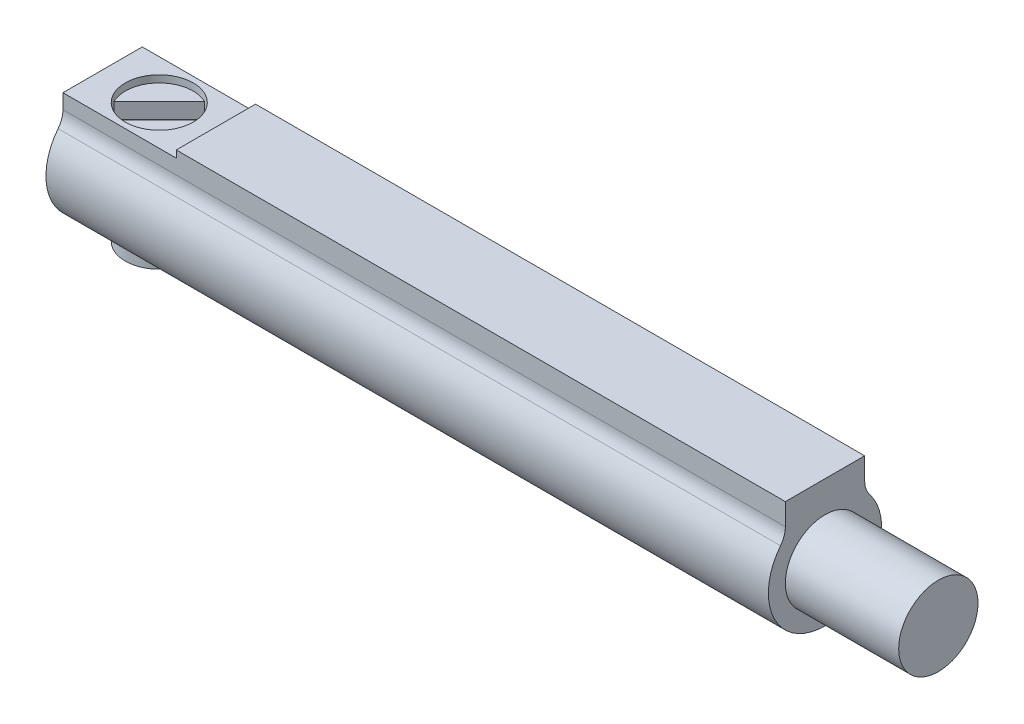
ISO-10303-21;
HEADER;
FILE_DESCRIPTION(('STEP AP214'),'2;1');
FILE_NAME('part.step','',(''),(''),'','','');
FILE_SCHEMA(('AUTOMOTIVE_DESIGN { 1 0 10303 214 1 1 1 1 }'));
ENDSEC;
DATA;
#1=APPLICATION_CONTEXT('core data for automotive mechanical design processes');
#2=APPLICATION_PROTOCOL_DEFINITION('international standard','automotive_design',2000,#1);
#3=PRODUCT_CONTEXT('',#1,'mechanical');
#4=PRODUCT('Part','Part','',(#3));
#5=PRODUCT_RELATED_PRODUCT_CATEGORY('part','',(#4));
#6=PRODUCT_DEFINITION_FORMATION('','',#4);
#7=PRODUCT_DEFINITION_CONTEXT('part definition',#1,'design');
#8=PRODUCT_DEFINITION('design','',#6,#7);
#9=PRODUCT_DEFINITION_SHAPE('','',#8);
#10=(LENGTH_UNIT() NAMED_UNIT(*) SI_UNIT(.MILLI.,.METRE.));
#11=(NAMED_UNIT(*) PLANE_ANGLE_UNIT() SI_UNIT($,.RADIAN.));
#12=(NAMED_UNIT(*) SI_UNIT($,.STERADIAN.) SOLID_ANGLE_UNIT());
#13=UNCERTAINTY_MEASURE_WITH_UNIT(LENGTH_MEASURE(1.E-05),#10,'distance_accuracy_value','');
#14=(GEOMETRIC_REPRESENTATION_CONTEXT(3) GLOBAL_UNCERTAINTY_ASSIGNED_CONTEXT((#13)) GLOBAL_UNIT_ASSIGNED_CONTEXT((#10,
#11,#12)) REPRESENTATION_CONTEXT('',''));
#15=CARTESIAN_POINT('',(0.,0.,0.));
#16=DIRECTION('',(0.,0.,1.));
#17=DIRECTION('',(1.,0.,0.));
#18=AXIS2_PLACEMENT_3D('',#15,#16,#17);
#19=CARTESIAN_POINT('',(2.,2.,0.));
#20=DIRECTION('',(0.,-1.,0.));
#21=DIRECTION('',(0.,0.,-1.));
#22=AXIS2_PLACEMENT_3D('',#19,#20,#21);
#23=PLANE('',#22);
#24=CARTESIAN_POINT('',(2.,2.,0.));
#25=DIRECTION('',(0.,-1.,0.));
#26=DIRECTION('',(0.,0.,-1.));
#27=AXIS2_PLACEMENT_3D('',#24,#25,#26);
#28=CIRCLE('',#27,1.1999999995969);
#29=CARTESIAN_POINT('',(2.517157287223,2.,-1.0828427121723));
#30=VERTEX_POINT('',#29);
#31=CARTESIAN_POINT('',(0.91715728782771,2.,0.51715728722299));
#32=VERTEX_POINT('',#31);
#33=EDGE_CURVE('E235',#30,#32,#28,.F.);
#34=ORIENTED_EDGE('',*,*,#33,.T.);
#35=DIRECTION('',(0.707106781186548,0.,-0.707106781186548));
#36=VECTOR('',#35,1.);
#37=CARTESIAN_POINT('',(1.71715728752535,2.,-0.28284271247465));
#38=LINE('',#37,#36);
#39=EDGE_CURVE('E11',#32,#30,#38,.T.);
#40=ORIENTED_EDGE('',*,*,#39,.T.);
#41=EDGE_LOOP('',(#34,#40));
#42=FACE_BOUND('',#41,.T.);
#43=ADVANCED_FACE('F33',(#42),#23,.F.);
#44=CARTESIAN_POINT('',(2.,-2.25,0.));
#45=DIRECTION('',(0.,1.,0.));
#46=DIRECTION('',(0.,0.,1.));
#47=AXIS2_PLACEMENT_3D('',#44,#45,#46);
#48=CYLINDRICAL_SURFACE('',#47,1.1999999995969);
#49=DIRECTION('',(0.,1.,0.));
#50=VECTOR('',#49,1.);
#51=CARTESIAN_POINT('',(0.91715728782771,1.45,0.51715728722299));
#52=LINE('',#51,#50);
#53=CARTESIAN_POINT('',(0.91715728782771,1.45,0.51715728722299));
#54=VERTEX_POINT('',#53);
#55=EDGE_CURVE('E155',#54,#32,#52,.T.);
#56=ORIENTED_EDGE('',*,*,#55,.T.);
#57=ORIENTED_EDGE('',*,*,#33,.F.);
#58=DIRECTION('',(0.,1.,0.));
#59=VECTOR('',#58,1.);
#60=CARTESIAN_POINT('',(2.517157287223,1.45,-1.0828427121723));
#61=LINE('',#60,#59);
#62=CARTESIAN_POINT('',(2.517157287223,1.45,-1.0828427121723));
#63=VERTEX_POINT('',#62);
#64=EDGE_CURVE('E158',#63,#30,#61,.T.);
#65=ORIENTED_EDGE('',*,*,#64,.F.);
#66=CARTESIAN_POINT('',(2.0000000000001,1.45,0.));
#67=DIRECTION('',(0.,1.,0.));
#68=DIRECTION('',(0.,0.,1.));
#69=AXIS2_PLACEMENT_3D('',#66,#67,#68);
#70=CIRCLE('',#69,1.19999999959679);
#71=CARTESIAN_POINT('',(3.08284271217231,1.45,-0.517157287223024));
#72=VERTEX_POINT('',#71);
#73=EDGE_CURVE('E147',#72,#63,#70,.T.);
#74=ORIENTED_EDGE('',*,*,#73,.F.);
#75=DIRECTION('',(0.,1.,0.));
#76=VECTOR('',#75,1.);
#77=CARTESIAN_POINT('',(3.08284271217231,1.45,-0.517157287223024));
#78=LINE('',#77,#76);
#79=CARTESIAN_POINT('',(3.08284271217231,2.,-0.517157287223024));
#80=VERTEX_POINT('',#79);
#81=EDGE_CURVE('E138',#72,#80,#78,.T.);
#82=ORIENTED_EDGE('',*,*,#81,.T.);
#83=CARTESIAN_POINT('',(1.48284271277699,2.,1.08284271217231));
#84=VERTEX_POINT('',#83);
#85=EDGE_CURVE('E137',#84,#80,#28,.F.);
#86=ORIENTED_EDGE('',*,*,#85,.F.);
#87=DIRECTION('',(0.,1.,0.));
#88=VECTOR('',#87,1.);
#89=CARTESIAN_POINT('',(1.482842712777,1.45,1.0828427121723));
#90=LINE('',#89,#88);
#91=CARTESIAN_POINT('',(1.482842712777,1.45,1.0828427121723));
#92=VERTEX_POINT('',#91);
#93=EDGE_CURVE('E48',#92,#84,#90,.T.);
#94=ORIENTED_EDGE('',*,*,#93,.F.);
#95=CARTESIAN_POINT('',(2.0000000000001,1.45,0.));
#96=DIRECTION('',(0.,1.,0.));
#97=DIRECTION('',(0.,0.,1.));
#98=AXIS2_PLACEMENT_3D('',#95,#96,#97);
#99=CIRCLE('',#98,1.19999999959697);
#100=EDGE_CURVE('E133',#54,#92,#99,.T.);
#101=ORIENTED_EDGE('',*,*,#100,.F.);
#102=EDGE_LOOP('',(#56,#57,#65,#74,#82,#86,#94,#101));
#103=FACE_BOUND('',#102,.T.);
#104=CARTESIAN_POINT('',(2.,2.25,0.));
#105=DIRECTION('',(0.,1.,0.));
#106=DIRECTION('',(0.,0.,1.));
#107=AXIS2_PLACEMENT_3D('',#104,#105,#106);
#108=CIRCLE('',#107,1.1999999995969);
#109=CARTESIAN_POINT('',(2.,2.25,1.1999999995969));
#110=VERTEX_POINT('',#109);
#111=EDGE_CURVE('E162',#110,#110,#108,.T.);
#112=ORIENTED_EDGE('',*,*,#111,.T.);
#113=EDGE_LOOP('',(#112));
#114=FACE_BOUND('',#113,.T.);
#115=ADVANCED_FACE('F130',(#103,#114),#48,.F.);
#116=CARTESIAN_POINT('',(25.5,2.25,-1.399999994));
#117=DIRECTION('',(0.,-1.,0.));
#118=DIRECTION('',(0.,0.,-1.));
#119=AXIS2_PLACEMENT_3D('',#116,#117,#118);
#120=PLANE('',#119);
#121=ORIENTED_EDGE('',*,*,#111,.F.);
#122=EDGE_LOOP('',(#121));
#123=FACE_BOUND('',#122,.T.);
#124=DIRECTION('',(0.,0.,1.));
#125=VECTOR('',#124,1.);
#126=CARTESIAN_POINT('',(4.,2.25,-1.399999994));
#127=LINE('',#126,#125);
#128=CARTESIAN_POINT('',(4.,2.25,-1.399999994));
#129=VERTEX_POINT('',#128);
#130=CARTESIAN_POINT('',(4.,2.25,1.399999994));
#131=VERTEX_POINT('',#130);
#132=EDGE_CURVE('E184',#129,#131,#127,.T.);
#133=ORIENTED_EDGE('',*,*,#132,.F.);
#134=DIRECTION('',(-1.,0.,0.));
#135=VECTOR('',#134,1.);
#136=CARTESIAN_POINT('',(25.5,2.25,-1.399999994));
#137=LINE('',#136,#135);
#138=CARTESIAN_POINT('',(0.,2.25,-1.399999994));
#139=VERTEX_POINT('',#138);
#140=EDGE_CURVE('E222',#129,#139,#137,.T.);
#141=ORIENTED_EDGE('',*,*,#140,.T.);
#142=DIRECTION('',(0.,0.,1.));
#143=VECTOR('',#142,1.);
#144=CARTESIAN_POINT('',(0.,2.25,-1.399999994));
#145=LINE('',#144,#143);
#146=CARTESIAN_POINT('',(0.,2.25,1.399999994));
#147=VERTEX_POINT('',#146);
#148=EDGE_CURVE('E214',#139,#147,#145,.T.);
#149=ORIENTED_EDGE('',*,*,#148,.T.);
#150=DIRECTION('',(-1.,0.,0.));
#151=VECTOR('',#150,1.);
#152=CARTESIAN_POINT('',(25.5,2.25,1.399999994));
#153=LINE('',#152,#151);
#154=EDGE_CURVE('E220',#131,#147,#153,.T.);
#155=ORIENTED_EDGE('',*,*,#154,.F.);
#156=EDGE_LOOP('',(#133,#141,#149,#155));
#157=FACE_BOUND('',#156,.T.);
#158=ADVANCED_FACE('F248',(#123,#157),#120,.F.);
#159=CARTESIAN_POINT('',(25.5,1.73205095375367,2.20000039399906));
#160=DIRECTION('',(-1.,0.,0.));
#161=DIRECTION('',(0.,0.,1.));
#162=AXIS2_PLACEMENT_3D('',#159,#160,#161);
#163=PLANE('',#162);
#164=CARTESIAN_POINT('',(25.5,0.,0.));
#165=DIRECTION('',(-1.,0.,0.));
#166=DIRECTION('',(0.,0.,1.));
#167=AXIS2_PLACEMENT_3D('',#164,#165,#166);
#168=CIRCLE('',#167,1.399999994);
#169=CARTESIAN_POINT('',(25.5,0.,1.399999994));
#170=VERTEX_POINT('',#169);
#171=EDGE_CURVE('E232',#170,#170,#168,.F.);
#172=ORIENTED_EDGE('',*,*,#171,.F.);
#173=EDGE_LOOP('',(#172));
#174=FACE_BOUND('',#173,.T.);
#175=DIRECTION('',(0.,-1.,0.));
#176=VECTOR('',#175,1.);
#177=CARTESIAN_POINT('',(25.5,2.25,1.399999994));
#178=LINE('',#177,#176);
#179=CARTESIAN_POINT('',(25.5,2.5,1.399999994));
#180=VERTEX_POINT('',#179);
#181=CARTESIAN_POINT('',(25.5,1.732050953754,1.399999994));
#182=VERTEX_POINT('',#181);
#183=EDGE_CURVE('E201',#180,#182,#178,.T.);
#184=ORIENTED_EDGE('',*,*,#183,.T.);
#185=CARTESIAN_POINT('',(25.5,1.73205095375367,2.20000039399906));
#186=DIRECTION('',(-1.,0.,0.));
#187=DIRECTION('',(0.,0.,1.));
#188=AXIS2_PLACEMENT_3D('',#185,#186,#187);
#189=CIRCLE('',#188,0.800000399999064);
#190=CARTESIAN_POINT('',(25.5,1.2371790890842,1.5714286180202));
#191=VERTEX_POINT('',#190);
#192=EDGE_CURVE('E191',#182,#191,#189,.T.);
#193=ORIENTED_EDGE('',*,*,#192,.T.);
#194=CARTESIAN_POINT('',(25.5,0.,0.));
#195=DIRECTION('',(1.,0.,0.));
#196=DIRECTION('',(0.,0.,-1.));
#197=AXIS2_PLACEMENT_3D('',#194,#195,#196);
#198=CIRCLE('',#197,2.00000000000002);
#199=CARTESIAN_POINT('',(25.5,1.2371791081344,-1.5714286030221));
#200=VERTEX_POINT('',#199);
#201=EDGE_CURVE('E194',#191,#200,#198,.T.);
#202=ORIENTED_EDGE('',*,*,#201,.T.);
#203=CARTESIAN_POINT('',(25.5,1.73205095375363,-2.20000039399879));
#204=DIRECTION('',(-1.,0.,0.));
#205=DIRECTION('',(0.,0.,1.));
#206=AXIS2_PLACEMENT_3D('',#203,#204,#205);
#207=CIRCLE('',#206,0.800000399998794);
#208=CARTESIAN_POINT('',(25.5,1.732050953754,-1.399999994));
#209=VERTEX_POINT('',#208);
#210=EDGE_CURVE('E197',#200,#209,#207,.T.);
#211=ORIENTED_EDGE('',*,*,#210,.T.);
#212=DIRECTION('',(0.,1.,0.));
#213=VECTOR('',#212,1.);
#214=CARTESIAN_POINT('',(25.5,1.732050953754,-1.399999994));
#215=LINE('',#214,#213);
#216=CARTESIAN_POINT('',(25.5,2.5,-1.399999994));
#217=VERTEX_POINT('',#216);
#218=EDGE_CURVE('E199',#209,#217,#215,.T.);
#219=ORIENTED_EDGE('',*,*,#218,.T.);
#220=DIRECTION('',(0.,0.,1.));
#221=VECTOR('',#220,1.);
#222=CARTESIAN_POINT('',(25.5,2.5,-1.399999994));
#223=LINE('',#222,#221);
#224=EDGE_CURVE('E166',#217,#180,#223,.T.);
#225=ORIENTED_EDGE('',*,*,#224,.T.);
#226=EDGE_LOOP('',(#184,#193,#202,#211,#219,#225));
#227=FACE_BOUND('',#226,.T.);
#228=ADVANCED_FACE('F268',(#174,#227),#163,.F.);
#229=CARTESIAN_POINT('',(25.5,1.73205095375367,2.20000039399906));
#230=DIRECTION('',(-1.,0.,0.));
#231=DIRECTION('',(0.,0.,1.));
#232=AXIS2_PLACEMENT_3D('',#229,#230,#231);
#233=CYLINDRICAL_SURFACE('',#232,0.800000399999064);
#234=CARTESIAN_POINT('',(0.,1.73205095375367,2.20000039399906));
#235=DIRECTION('',(-1.,0.,0.));
#236=DIRECTION('',(0.,0.,1.));
#237=AXIS2_PLACEMENT_3D('',#234,#235,#236);
#238=CIRCLE('',#237,0.800000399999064);
#239=CARTESIAN_POINT('',(0.,1.732050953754,1.399999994));
#240=VERTEX_POINT('',#239);
#241=CARTESIAN_POINT('',(0.,1.2371790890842,1.5714286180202));
#242=VERTEX_POINT('',#241);
#243=EDGE_CURVE('E190',#240,#242,#238,.T.);
#244=ORIENTED_EDGE('',*,*,#243,.T.);
#245=DIRECTION('',(-1.,0.,0.));
#246=VECTOR('',#245,1.);
#247=CARTESIAN_POINT('',(25.5,1.2371790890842,1.5714286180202));
#248=LINE('',#247,#246);
#249=EDGE_CURVE('E229',#191,#242,#248,.T.);
#250=ORIENTED_EDGE('',*,*,#249,.F.);
#251=ORIENTED_EDGE('',*,*,#192,.F.);
#252=DIRECTION('',(-1.,0.,0.));
#253=VECTOR('',#252,1.);
#254=CARTESIAN_POINT('',(25.5,1.732050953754,1.399999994));
#255=LINE('',#254,#253);
#256=EDGE_CURVE('E203',#182,#240,#255,.T.);
#257=ORIENTED_EDGE('',*,*,#256,.T.);
#258=EDGE_LOOP('',(#244,#250,#251,#257));
#259=FACE_BOUND('',#258,.T.);
#260=ADVANCED_FACE('F35',(#259),#233,.F.);
#261=CARTESIAN_POINT('',(25.5,0.,0.));
#262=DIRECTION('',(-1.,0.,0.));
#263=DIRECTION('',(0.,0.,1.));
#264=AXIS2_PLACEMENT_3D('',#261,#262,#263);
#265=CYLINDRICAL_SURFACE('',#264,2.00000000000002);
#266=CARTESIAN_POINT('',(2.,-1.60000000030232,1.1999999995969));
#267=CARTESIAN_POINT('',(2.06038318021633,-1.59999533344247,1.20000323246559));
#268=CARTESIAN_POINT('',(2.12075074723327,-1.60346907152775,1.19541482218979));
#269=CARTESIAN_POINT('',(2.23945912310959,-1.61674072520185,1.17739972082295));
#270=CARTESIAN_POINT('',(2.29779774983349,-1.62654524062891,1.16396380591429));
#271=CARTESIAN_POINT('',(2.41046691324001,-1.65089871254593,1.12914789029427));
#272=CARTESIAN_POINT('',(2.46482307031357,-1.66541332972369,1.107825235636));
#273=CARTESIAN_POINT('',(2.56914996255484,-1.69748724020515,1.05802327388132));
#274=CARTESIAN_POINT('',(2.61911938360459,-1.71504744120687,1.02954183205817));
#275=CARTESIAN_POINT('',(2.71995921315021,-1.75382875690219,0.962170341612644));
#276=CARTESIAN_POINT('',(2.77019276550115,-1.77523496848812,0.922433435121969));
#277=CARTESIAN_POINT('',(2.86381180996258,-1.81780983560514,0.835414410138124));
#278=CARTESIAN_POINT('',(2.90719212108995,-1.83897830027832,0.788126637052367));
#279=CARTESIAN_POINT('',(2.9905070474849,-1.88140454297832,0.681153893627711));
#280=CARTESIAN_POINT('',(3.02956357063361,-1.90242506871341,0.620681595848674));
#281=CARTESIAN_POINT('',(3.09664777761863,-1.93955029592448,0.492523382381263));
#282=CARTESIAN_POINT('',(3.12468557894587,-1.95565950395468,0.424844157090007));
#283=CARTESIAN_POINT('',(3.16607673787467,-1.97976790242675,0.291017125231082));
#284=CARTESIAN_POINT('',(3.18057628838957,-1.98839443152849,0.225339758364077));
#285=CARTESIAN_POINT('',(3.19835424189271,-1.9989995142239,0.0919764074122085));
#286=CARTESIAN_POINT('',(3.20164318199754,-2.00098431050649,0.0242923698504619));
#287=CARTESIAN_POINT('',(3.19710900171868,-1.99826698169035,-0.102109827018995));
#288=CARTESIAN_POINT('',(3.19061317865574,-1.99436350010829,-0.160899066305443));
#289=CARTESIAN_POINT('',(3.16921616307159,-1.98166398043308,-0.276371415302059));
#290=CARTESIAN_POINT('',(3.15431434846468,-1.97286758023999,-0.333054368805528));
#291=CARTESIAN_POINT('',(3.11666754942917,-1.95107925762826,-0.443245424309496));
#292=CARTESIAN_POINT('',(3.09387755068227,-1.93806328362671,-0.496733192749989));
#293=CARTESIAN_POINT('',(3.04129230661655,-1.90887710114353,-0.599190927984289));
#294=CARTESIAN_POINT('',(3.01149524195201,-1.89270607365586,-0.648159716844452));
#295=CARTESIAN_POINT('',(2.9417287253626,-1.85630340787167,-0.746459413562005));
#296=CARTESIAN_POINT('',(2.90096935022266,-1.8358174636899,-0.795134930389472));
#297=CARTESIAN_POINT('',(2.81247670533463,-1.7940444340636,-0.885371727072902));
#298=CARTESIAN_POINT('',(2.76473399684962,-1.77275629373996,-0.926923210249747));
#299=CARTESIAN_POINT('',(2.65707727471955,-1.72888860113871,-1.00659870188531));
#300=CARTESIAN_POINT('',(2.59639393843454,-1.70644529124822,-1.04376746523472));
#301=CARTESIAN_POINT('',(2.46823501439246,-1.66600703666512,-1.10717773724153));
#302=CARTESIAN_POINT('',(2.40077222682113,-1.64800392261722,-1.13343937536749));
#303=CARTESIAN_POINT('',(2.27808509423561,-1.62316692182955,-1.16861997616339));
#304=CARTESIAN_POINT('',(2.22396749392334,-1.61467110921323,-1.18022322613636));
#305=CARTESIAN_POINT('',(2.11410111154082,-1.60313720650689,-1.19584698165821));
#306=CARTESIAN_POINT('',(2.05835430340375,-1.60009276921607,-1.1998763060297));
#307=CARTESIAN_POINT('',(1.94675865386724,-1.59991131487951,-1.20011824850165));
#308=CARTESIAN_POINT('',(1.89090977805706,-1.60278248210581,-1.19632003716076));
#309=CARTESIAN_POINT('',(1.78081012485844,-1.61401216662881,-1.1811223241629));
#310=CARTESIAN_POINT('',(1.72656064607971,-1.62237502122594,-1.16971681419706));
#311=CARTESIAN_POINT('',(1.62102833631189,-1.64345414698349,-1.13990650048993));
#312=CARTESIAN_POINT('',(1.56974189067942,-1.65616497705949,-1.12151044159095));
#313=CARTESIAN_POINT('',(1.47081782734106,-1.68457231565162,-1.07837008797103));
#314=CARTESIAN_POINT('',(1.42318159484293,-1.70026994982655,-1.05362339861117));
#315=CARTESIAN_POINT('',(1.32380793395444,-1.73629455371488,-0.993339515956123));
#316=CARTESIAN_POINT('',(1.27287933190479,-1.75694591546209,-0.956661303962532));
#317=CARTESIAN_POINT('',(1.17737161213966,-1.79857403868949,-0.87589916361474));
#318=CARTESIAN_POINT('',(1.13279864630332,-1.8195510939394,-0.831808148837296));
#319=CARTESIAN_POINT('',(1.04542079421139,-1.86268500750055,-0.730619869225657));
#320=CARTESIAN_POINT('',(1.00359941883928,-1.88464060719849,-0.672576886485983));
#321=CARTESIAN_POINT('',(0.930477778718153,-1.92430111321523,-0.548882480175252));
#322=CARTESIAN_POINT('',(0.89917053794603,-1.9420088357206,-0.483236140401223));
#323=CARTESIAN_POINT('',(0.850505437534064,-1.97001824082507,-0.351072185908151));
#324=CARTESIAN_POINT('',(0.832299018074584,-1.98076470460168,-0.284964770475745));
#325=CARTESIAN_POINT('',(0.807428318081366,-1.99552591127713,-0.149906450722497));
#326=CARTESIAN_POINT('',(0.800750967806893,-1.99954827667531,-0.0809588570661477));
#327=CARTESIAN_POINT('',(0.799460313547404,-2.00032480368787,0.0478496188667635));
#328=CARTESIAN_POINT('',(0.803357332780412,-1.99797645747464,0.107696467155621));
#329=CARTESIAN_POINT('',(0.81991505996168,-1.98810358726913,0.22571900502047));
#330=CARTESIAN_POINT('',(0.832575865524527,-1.98057900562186,0.283894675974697));
#331=CARTESIAN_POINT('',(0.865775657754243,-1.96119542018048,0.396116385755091));
#332=CARTESIAN_POINT('',(0.886185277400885,-1.94940773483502,0.450213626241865));
#333=CARTESIAN_POINT('',(0.93411247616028,-1.92242669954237,0.554225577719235));
#334=CARTESIAN_POINT('',(0.961631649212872,-1.90723258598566,0.604139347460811));
#335=CARTESIAN_POINT('',(1.02634015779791,-1.87274746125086,0.704210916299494));
#336=CARTESIAN_POINT('',(1.0642549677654,-1.85319075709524,0.75380695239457));
#337=CARTESIAN_POINT('',(1.14700242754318,-1.81281525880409,0.846318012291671));
#338=CARTESIAN_POINT('',(1.19184274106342,-1.79199508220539,0.889225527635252));
#339=CARTESIAN_POINT('',(1.29382845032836,-1.74822532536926,0.972727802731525));
#340=CARTESIAN_POINT('',(1.35181318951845,-1.72534053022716,1.0123392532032));
#341=CARTESIAN_POINT('',(1.47478788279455,-1.68301171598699,1.08125453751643));
#342=CARTESIAN_POINT('',(1.53977417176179,-1.66356591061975,1.11056373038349));
#343=CARTESIAN_POINT('',(1.66965142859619,-1.63264002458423,1.1554969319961));
#344=CARTESIAN_POINT('',(1.73407618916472,-1.62062132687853,1.1720762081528));
#345=CARTESIAN_POINT('',(1.86567791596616,-1.60431225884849,1.19431414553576));
#346=CARTESIAN_POINT('',(1.93284861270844,-1.60000519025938,1.19999640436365));
#347=CARTESIAN_POINT('',(2.,-1.60000000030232,1.1999999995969));
#348=B_SPLINE_CURVE_WITH_KNOTS('',3,(#266,#267,#268,#269,#270,#271,#272,#273,#274,#275,#276,
#277,#278,#279,#280,#281,#282,#283,#284,#285,#286,#287,#288,#289,#290,#291,#292,#293,#294,#295,
#296,#297,#298,#299,#300,#301,#302,#303,#304,#305,#306,#307,#308,#309,#310,#311,#312,#313,#314,
#315,#316,#317,#318,#319,#320,#321,#322,#323,#324,#325,#326,#327,#328,#329,#330,#331,#332,#333,
#334,#335,#336,#337,#338,#339,#340,#341,#342,#343,#344,#345,#346,#347),.UNSPECIFIED.,.T.,.F.,(4,
2,2,2,2,2,2,2,2,2,2,2,2,2,2,2,2,2,2,2,2,2,2,2,2,2,2,2,2,2,2,2,2,2,2,2,2,2,2,2,4),(0.,
0.180868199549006,0.361925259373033,0.54169089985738,0.721510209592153,0.923315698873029,
1.12527302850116,1.34904126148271,1.57260354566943,1.77482664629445,1.97685962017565,
2.15384104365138,2.33083556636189,2.50885723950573,2.68692518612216,2.88626247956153,
3.08587173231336,3.30861336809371,3.53094208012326,3.69821038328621,3.86528380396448,
4.03258852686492,4.2000255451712,4.36725379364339,4.53454519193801,4.73199550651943,
4.92963566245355,5.15297462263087,5.37616510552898,5.58313183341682,5.78986378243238,
5.96903457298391,6.14820735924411,6.32451175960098,6.50085572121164,6.6963437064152,
6.89204958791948,7.11257356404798,7.33298265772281,7.53456095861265,7.73570224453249),.UNSPECIFIED.);
#349=CARTESIAN_POINT('',(3.1999999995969,-2.,0.));
#350=VERTEX_POINT('',#349);
#351=CARTESIAN_POINT('',(0.8000000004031,-2.,0.));
#352=VERTEX_POINT('',#351);
#353=EDGE_CURVE('E175',#350,#352,#348,.T.);
#354=ORIENTED_EDGE('',*,*,#353,.T.);
#355=EDGE_CURVE('E165',#352,#350,#348,.T.);
#356=ORIENTED_EDGE('',*,*,#355,.T.);
#357=EDGE_LOOP('',(#354,#356));
#358=FACE_BOUND('',#357,.T.);
#359=CARTESIAN_POINT('',(0.,0.,0.));
#360=DIRECTION('',(1.,0.,0.));
#361=DIRECTION('',(0.,0.,-1.));
#362=AXIS2_PLACEMENT_3D('',#359,#360,#361);
#363=CIRCLE('',#362,2.00000000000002);
#364=CARTESIAN_POINT('',(0.,1.2371791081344,-1.5714286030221));
#365=VERTEX_POINT('',#364);
#366=EDGE_CURVE('E206',#242,#365,#363,.T.);
#367=ORIENTED_EDGE('',*,*,#366,.T.);
#368=DIRECTION('',(-1.,0.,0.));
#369=VECTOR('',#368,1.);
#370=CARTESIAN_POINT('',(25.5,1.2371791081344,-1.5714286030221));
#371=LINE('',#370,#369);
#372=EDGE_CURVE('E226',#200,#365,#371,.T.);
#373=ORIENTED_EDGE('',*,*,#372,.F.);
#374=ORIENTED_EDGE('',*,*,#201,.F.);
#375=ORIENTED_EDGE('',*,*,#249,.T.);
#376=EDGE_LOOP('',(#367,#373,#374,#375));
#377=FACE_BOUND('',#376,.T.);
#378=ADVANCED_FACE('F241',(#358,#377),#265,.T.);
#379=CARTESIAN_POINT('',(25.5,1.73205095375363,-2.20000039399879));
#380=DIRECTION('',(-1.,0.,0.));
#381=DIRECTION('',(0.,0.,1.));
#382=AXIS2_PLACEMENT_3D('',#379,#380,#381);
#383=CYLINDRICAL_SURFACE('',#382,0.800000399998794);
#384=CARTESIAN_POINT('',(0.,1.73205095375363,-2.20000039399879));
#385=DIRECTION('',(-1.,0.,0.));
#386=DIRECTION('',(0.,0.,1.));
#387=AXIS2_PLACEMENT_3D('',#384,#385,#386);
#388=CIRCLE('',#387,0.800000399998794);
#389=CARTESIAN_POINT('',(0.,1.732050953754,-1.399999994));
#390=VERTEX_POINT('',#389);
#391=EDGE_CURVE('E208',#365,#390,#388,.T.);
#392=ORIENTED_EDGE('',*,*,#391,.T.);
#393=DIRECTION('',(-1.,0.,0.));
#394=VECTOR('',#393,1.);
#395=CARTESIAN_POINT('',(25.5,1.732050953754,-1.399999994));
#396=LINE('',#395,#394);
#397=EDGE_CURVE('E224',#209,#390,#396,.T.);
#398=ORIENTED_EDGE('',*,*,#397,.F.);
#399=ORIENTED_EDGE('',*,*,#210,.F.);
#400=ORIENTED_EDGE('',*,*,#372,.T.);
#401=EDGE_LOOP('',(#392,#398,#399,#400));
#402=FACE_BOUND('',#401,.T.);
#403=ADVANCED_FACE('F284',(#402),#383,.F.);
#404=CARTESIAN_POINT('',(25.5,1.732050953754,-1.399999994));
#405=DIRECTION('',(0.,0.,1.));
#406=DIRECTION('',(1.,0.,0.));
#407=AXIS2_PLACEMENT_3D('',#404,#405,#406);
#408=PLANE('',#407);
#409=ORIENTED_EDGE('',*,*,#397,.T.);
#410=DIRECTION('',(0.,1.,0.));
#411=VECTOR('',#410,1.);
#412=CARTESIAN_POINT('',(0.,1.732050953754,-1.399999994));
#413=LINE('',#412,#411);
#414=EDGE_CURVE('E211',#390,#139,#413,.T.);
#415=ORIENTED_EDGE('',*,*,#414,.T.);
#416=ORIENTED_EDGE('',*,*,#140,.F.);
#417=DIRECTION('',(0.,1.,0.));
#418=VECTOR('',#417,1.);
#419=CARTESIAN_POINT('',(4.,0.5,-1.399999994));
#420=LINE('',#419,#418);
#421=CARTESIAN_POINT('',(4.,2.5,-1.399999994));
#422=VERTEX_POINT('',#421);
#423=EDGE_CURVE('E170',#129,#422,#420,.T.);
#424=ORIENTED_EDGE('',*,*,#423,.T.);
#425=DIRECTION('',(-1.,0.,0.));
#426=VECTOR('',#425,1.);
#427=CARTESIAN_POINT('',(25.5,2.5,-1.399999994));
#428=LINE('',#427,#426);
#429=EDGE_CURVE('E169',#217,#422,#428,.T.);
#430=ORIENTED_EDGE('',*,*,#429,.F.);
#431=ORIENTED_EDGE('',*,*,#218,.F.);
#432=EDGE_LOOP('',(#409,#415,#416,#424,#430,#431));
#433=FACE_BOUND('',#432,.T.);
#434=ADVANCED_FACE('F278',(#433),#408,.F.);
#435=CARTESIAN_POINT('',(25.5,2.25,1.399999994));
#436=DIRECTION('',(0.,0.,-1.));
#437=DIRECTION('',(-1.,0.,0.));
#438=AXIS2_PLACEMENT_3D('',#435,#436,#437);
#439=PLANE('',#438);
#440=ORIENTED_EDGE('',*,*,#183,.F.);
#441=DIRECTION('',(-1.,0.,0.));
#442=VECTOR('',#441,1.);
#443=CARTESIAN_POINT('',(25.5,2.5,1.399999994));
#444=LINE('',#443,#442);
#445=CARTESIAN_POINT('',(4.,2.5,1.399999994));
#446=VERTEX_POINT('',#445);
#447=EDGE_CURVE('E181',#180,#446,#444,.T.);
#448=ORIENTED_EDGE('',*,*,#447,.T.);
#449=DIRECTION('',(0.,-1.,0.));
#450=VECTOR('',#449,1.);
#451=CARTESIAN_POINT('',(4.,2.5,1.399999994));
#452=LINE('',#451,#450);
#453=EDGE_CURVE('E174',#446,#131,#452,.T.);
#454=ORIENTED_EDGE('',*,*,#453,.T.);
#455=ORIENTED_EDGE('',*,*,#154,.T.);
#456=DIRECTION('',(0.,-1.,0.));
#457=VECTOR('',#456,1.);
#458=CARTESIAN_POINT('',(0.,2.25,1.399999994));
#459=LINE('',#458,#457);
#460=EDGE_CURVE('E195',#147,#240,#459,.T.);
#461=ORIENTED_EDGE('',*,*,#460,.T.);
#462=ORIENTED_EDGE('',*,*,#256,.F.);
#463=EDGE_LOOP('',(#440,#448,#454,#455,#461,#462));
#464=FACE_BOUND('',#463,.T.);
#465=ADVANCED_FACE('F274',(#464),#439,.F.);
#466=CARTESIAN_POINT('',(0.,1.73205095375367,2.20000039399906));
#467=DIRECTION('',(-1.,0.,0.));
#468=DIRECTION('',(0.,0.,1.));
#469=AXIS2_PLACEMENT_3D('',#466,#467,#468);
#470=PLANE('',#469);
#471=ORIENTED_EDGE('',*,*,#243,.F.);
#472=ORIENTED_EDGE('',*,*,#460,.F.);
#473=ORIENTED_EDGE('',*,*,#148,.F.);
#474=ORIENTED_EDGE('',*,*,#414,.F.);
#475=ORIENTED_EDGE('',*,*,#391,.F.);
#476=ORIENTED_EDGE('',*,*,#366,.F.);
#477=EDGE_LOOP('',(#471,#472,#473,#474,#475,#476));
#478=FACE_BOUND('',#477,.T.);
#479=ADVANCED_FACE('F266',(#478),#470,.T.);
#480=CARTESIAN_POINT('',(29.5,0.,0.));
#481=DIRECTION('',(-1.,0.,0.));
#482=DIRECTION('',(0.,0.,1.));
#483=AXIS2_PLACEMENT_3D('',#480,#481,#482);
#484=CYLINDRICAL_SURFACE('',#483,1.399999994);
#485=CARTESIAN_POINT('',(29.5,0.,0.));
#486=DIRECTION('',(1.,0.,0.));
#487=DIRECTION('',(0.,0.,-1.));
#488=AXIS2_PLACEMENT_3D('',#485,#486,#487);
#489=CIRCLE('',#488,1.399999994);
#490=CARTESIAN_POINT('',(29.5,0.,-1.399999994));
#491=VERTEX_POINT('',#490);
#492=EDGE_CURVE('E187',#491,#491,#489,.T.);
#493=ORIENTED_EDGE('',*,*,#492,.F.);
#494=EDGE_LOOP('',(#493));
#495=FACE_BOUND('',#494,.T.);
#496=ORIENTED_EDGE('',*,*,#171,.T.);
#497=EDGE_LOOP('',(#496));
#498=FACE_BOUND('',#497,.T.);
#499=ADVANCED_FACE('F262',(#495,#498),#484,.T.);
#500=CARTESIAN_POINT('',(29.5,0.,0.));
#501=DIRECTION('',(1.,0.,0.));
#502=DIRECTION('',(0.,0.,-1.));
#503=AXIS2_PLACEMENT_3D('',#500,#501,#502);
#504=PLANE('',#503);
#505=ORIENTED_EDGE('',*,*,#492,.T.);
#506=EDGE_LOOP('',(#505));
#507=FACE_BOUND('',#506,.T.);
#508=ADVANCED_FACE('F255',(#507),#504,.T.);
#509=CARTESIAN_POINT('',(4.,2.5,1.399999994));
#510=DIRECTION('',(1.,0.,0.));
#511=DIRECTION('',(0.,0.,-1.));
#512=AXIS2_PLACEMENT_3D('',#509,#510,#511);
#513=PLANE('',#512);
#514=ORIENTED_EDGE('',*,*,#423,.F.);
#515=ORIENTED_EDGE('',*,*,#132,.T.);
#516=ORIENTED_EDGE('',*,*,#453,.F.);
#517=DIRECTION('',(0.,0.,1.));
#518=VECTOR('',#517,1.);
#519=CARTESIAN_POINT('',(4.,2.5,-1.399999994));
#520=LINE('',#519,#518);
#521=EDGE_CURVE('E171',#422,#446,#520,.T.);
#522=ORIENTED_EDGE('',*,*,#521,.F.);
#523=EDGE_LOOP('',(#514,#515,#516,#522));
#524=FACE_BOUND('',#523,.T.);
#525=ADVANCED_FACE('F251',(#524),#513,.F.);
#526=CARTESIAN_POINT('',(25.5,2.5,-1.399999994));
#527=DIRECTION('',(0.,-1.,0.));
#528=DIRECTION('',(0.,0.,-1.));
#529=AXIS2_PLACEMENT_3D('',#526,#527,#528);
#530=PLANE('',#529);
#531=ORIENTED_EDGE('',*,*,#521,.T.);
#532=ORIENTED_EDGE('',*,*,#447,.F.);
#533=ORIENTED_EDGE('',*,*,#224,.F.);
#534=ORIENTED_EDGE('',*,*,#429,.T.);
#535=EDGE_LOOP('',(#531,#532,#533,#534));
#536=FACE_BOUND('',#535,.T.);
#537=ADVANCED_FACE('F254',(#536),#530,.F.);
#538=ORIENTED_EDGE('',*,*,#85,.T.);
#539=DIRECTION('',(-0.707106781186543,0.,0.707106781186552));
#540=VECTOR('',#539,1.);
#541=CARTESIAN_POINT('',(2.28284271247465,2.,0.282842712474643));
#542=LINE('',#541,#540);
#543=EDGE_CURVE('E41',#80,#84,#542,.T.);
#544=ORIENTED_EDGE('',*,*,#543,.T.);
#545=EDGE_LOOP('',(#538,#544));
#546=FACE_BOUND('',#545,.T.);
#547=ADVANCED_FACE('F249',(#546),#23,.F.);
#548=CARTESIAN_POINT('',(2.,-2.,0.));
#549=DIRECTION('',(0.,1.,0.));
#550=DIRECTION('',(0.,0.,1.));
#551=AXIS2_PLACEMENT_3D('',#548,#549,#550);
#552=CYLINDRICAL_SURFACE('',#551,1.1999999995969);
#553=CARTESIAN_POINT('',(2.,-2.,0.));
#554=DIRECTION('',(0.,1.,0.));
#555=DIRECTION('',(0.,0.,1.));
#556=AXIS2_PLACEMENT_3D('',#553,#554,#555);
#557=CIRCLE('',#556,1.1999999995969);
#558=EDGE_CURVE('E55',#350,#352,#557,.T.);
#559=ORIENTED_EDGE('',*,*,#558,.T.);
#560=ORIENTED_EDGE('',*,*,#353,.F.);
#561=EDGE_LOOP('',(#559,#560));
#562=FACE_BOUND('',#561,.T.);
#563=ADVANCED_FACE('F298',(#562),#552,.T.);
#564=EDGE_CURVE('E157',#352,#350,#557,.T.);
#565=ORIENTED_EDGE('',*,*,#564,.T.);
#566=ORIENTED_EDGE('',*,*,#355,.F.);
#567=EDGE_LOOP('',(#565,#566));
#568=FACE_BOUND('',#567,.T.);
#569=ADVANCED_FACE('F303',(#568),#552,.T.);
#570=CARTESIAN_POINT('',(3.1999999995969,-2.,0.));
#571=DIRECTION('',(0.,1.,0.));
#572=DIRECTION('',(0.,0.,1.));
#573=AXIS2_PLACEMENT_3D('',#570,#571,#572);
#574=PLANE('',#573);
#575=ORIENTED_EDGE('',*,*,#558,.F.);
#576=ORIENTED_EDGE('',*,*,#564,.F.);
#577=EDGE_LOOP('',(#575,#576));
#578=FACE_BOUND('',#577,.T.);
#579=ADVANCED_FACE('F309',(#578),#574,.F.);
#580=CARTESIAN_POINT('',(2.517157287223,1.45,-1.0828427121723));
#581=DIRECTION('',(-0.707106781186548,0.,-0.707106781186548));
#582=DIRECTION('',(-0.707106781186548,0.,0.707106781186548));
#583=AXIS2_PLACEMENT_3D('',#580,#581,#582);
#584=PLANE('',#583);
#585=ORIENTED_EDGE('',*,*,#55,.F.);
#586=DIRECTION('',(-0.707106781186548,0.,0.707106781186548));
#587=VECTOR('',#586,1.);
#588=CARTESIAN_POINT('',(2.517157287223,1.45,-1.0828427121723));
#589=LINE('',#588,#587);
#590=EDGE_CURVE('E139',#63,#54,#589,.T.);
#591=ORIENTED_EDGE('',*,*,#590,.F.);
#592=ORIENTED_EDGE('',*,*,#64,.T.);
#593=ORIENTED_EDGE('',*,*,#39,.F.);
#594=EDGE_LOOP('',(#585,#591,#592,#593));
#595=FACE_BOUND('',#594,.T.);
#596=ADVANCED_FACE('F307',(#595),#584,.F.);
#597=CARTESIAN_POINT('',(1.482842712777,1.45,1.0828427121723));
#598=DIRECTION('',(0.707106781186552,0.,0.707106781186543));
#599=DIRECTION('',(0.707106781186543,0.,-0.707106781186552));
#600=AXIS2_PLACEMENT_3D('',#597,#598,#599);
#601=PLANE('',#600);
#602=ORIENTED_EDGE('',*,*,#81,.F.);
#603=DIRECTION('',(0.707106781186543,0.,-0.707106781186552));
#604=VECTOR('',#603,1.);
#605=CARTESIAN_POINT('',(1.482842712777,1.45,1.0828427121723));
#606=LINE('',#605,#604);
#607=EDGE_CURVE('E142',#92,#72,#606,.T.);
#608=ORIENTED_EDGE('',*,*,#607,.F.);
#609=ORIENTED_EDGE('',*,*,#93,.T.);
#610=ORIENTED_EDGE('',*,*,#543,.F.);
#611=EDGE_LOOP('',(#602,#608,#609,#610));
#612=FACE_BOUND('',#611,.T.);
#613=ADVANCED_FACE('F143',(#612),#601,.F.);
#614=CARTESIAN_POINT('',(2.0000000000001,1.45,0.));
#615=DIRECTION('',(0.,1.,0.));
#616=DIRECTION('',(0.,0.,1.));
#617=AXIS2_PLACEMENT_3D('',#614,#615,#616);
#618=PLANE('',#617);
#619=ORIENTED_EDGE('',*,*,#100,.T.);
#620=ORIENTED_EDGE('',*,*,#607,.T.);
#621=ORIENTED_EDGE('',*,*,#73,.T.);
#622=ORIENTED_EDGE('',*,*,#590,.T.);
#623=EDGE_LOOP('',(#619,#620,#621,#622));
#624=FACE_BOUND('',#623,.T.);
#625=ADVANCED_FACE('F149',(#624),#618,.T.);
#626=CLOSED_SHELL('',(#43,#115,#158,#228,#260,#378,#403,#434,#465,#479,#499,#508,#525,#537,#547,
#563,#569,#579,#596,#613,#625));
#627=MANIFOLD_SOLID_BREP('B2',#626);
#628=ADVANCED_BREP_SHAPE_REPRESENTATION('',(#18,#627),#14);
#629=SHAPE_DEFINITION_REPRESENTATION(#9,#628);
ENDSEC;
END-ISO-10303-21;
